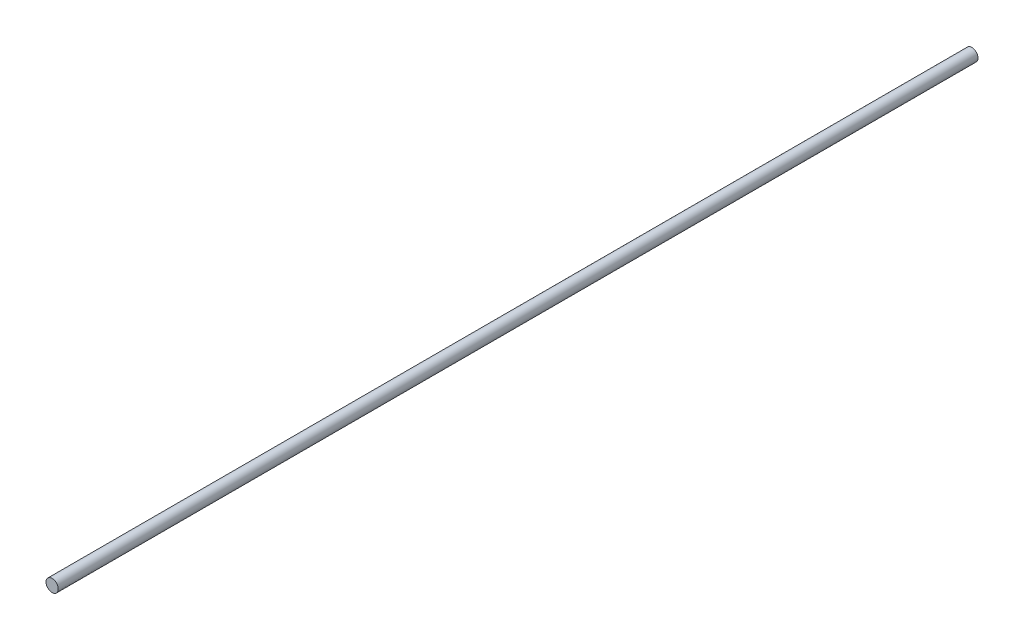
ISO-10303-21;
HEADER;
FILE_DESCRIPTION(('STEP AP214'),'2;1');
FILE_NAME('part.step','',(''),(''),'','','');
FILE_SCHEMA(('AUTOMOTIVE_DESIGN { 1 0 10303 214 1 1 1 1 }'));
ENDSEC;
DATA;
#1=APPLICATION_CONTEXT('core data for automotive mechanical design processes');
#2=APPLICATION_PROTOCOL_DEFINITION('international standard','automotive_design',2000,#1);
#3=PRODUCT_CONTEXT('',#1,'mechanical');
#4=PRODUCT('Part','Part','',(#3));
#5=PRODUCT_RELATED_PRODUCT_CATEGORY('part','',(#4));
#6=PRODUCT_DEFINITION_FORMATION('','',#4);
#7=PRODUCT_DEFINITION_CONTEXT('part definition',#1,'design');
#8=PRODUCT_DEFINITION('design','',#6,#7);
#9=PRODUCT_DEFINITION_SHAPE('','',#8);
#10=(LENGTH_UNIT() NAMED_UNIT(*) SI_UNIT(.MILLI.,.METRE.));
#11=(NAMED_UNIT(*) PLANE_ANGLE_UNIT() SI_UNIT($,.RADIAN.));
#12=(NAMED_UNIT(*) SI_UNIT($,.STERADIAN.) SOLID_ANGLE_UNIT());
#13=UNCERTAINTY_MEASURE_WITH_UNIT(LENGTH_MEASURE(1.E-05),#10,'distance_accuracy_value','');
#14=(GEOMETRIC_REPRESENTATION_CONTEXT(3) GLOBAL_UNCERTAINTY_ASSIGNED_CONTEXT((#13)) GLOBAL_UNIT_ASSIGNED_CONTEXT((#10,
#11,#12)) REPRESENTATION_CONTEXT('',''));
#15=CARTESIAN_POINT('',(0.,0.,0.));
#16=DIRECTION('',(0.,0.,1.));
#17=DIRECTION('',(1.,0.,0.));
#18=AXIS2_PLACEMENT_3D('',#15,#16,#17);
#19=CARTESIAN_POINT('',(0.,0.,450.));
#20=DIRECTION('',(0.,0.,-1.));
#21=DIRECTION('',(-1.,0.,0.));
#22=AXIS2_PLACEMENT_3D('',#19,#20,#21);
#23=CYLINDRICAL_SURFACE('',#22,3.);
#24=CARTESIAN_POINT('',(0.,0.,450.));
#25=DIRECTION('',(0.,0.,1.));
#26=DIRECTION('',(1.,0.,0.));
#27=AXIS2_PLACEMENT_3D('',#24,#25,#26);
#28=CIRCLE('',#27,3.);
#29=CARTESIAN_POINT('',(3.,0.,450.));
#30=VERTEX_POINT('',#29);
#31=EDGE_CURVE('E10',#30,#30,#28,.T.);
#32=ORIENTED_EDGE('',*,*,#31,.F.);
#33=EDGE_LOOP('',(#32));
#34=FACE_BOUND('',#33,.T.);
#35=CARTESIAN_POINT('',(0.,0.,0.));
#36=DIRECTION('',(0.,0.,1.));
#37=DIRECTION('',(1.,0.,0.));
#38=AXIS2_PLACEMENT_3D('',#35,#36,#37);
#39=CIRCLE('',#38,3.);
#40=CARTESIAN_POINT('',(3.,0.,0.));
#41=VERTEX_POINT('',#40);
#42=EDGE_CURVE('E33',#41,#41,#39,.T.);
#43=ORIENTED_EDGE('',*,*,#42,.T.);
#44=EDGE_LOOP('',(#43));
#45=FACE_BOUND('',#44,.T.);
#46=ADVANCED_FACE('F30',(#34,#45),#23,.T.);
#47=CARTESIAN_POINT('',(0.,0.,450.));
#48=DIRECTION('',(0.,0.,1.));
#49=DIRECTION('',(1.,0.,0.));
#50=AXIS2_PLACEMENT_3D('',#47,#48,#49);
#51=PLANE('',#50);
#52=ORIENTED_EDGE('',*,*,#31,.T.);
#53=EDGE_LOOP('',(#52));
#54=FACE_BOUND('',#53,.T.);
#55=ADVANCED_FACE('F45',(#54),#51,.T.);
#56=CARTESIAN_POINT('',(0.,0.,0.));
#57=DIRECTION('',(0.,0.,1.));
#58=DIRECTION('',(1.,0.,0.));
#59=AXIS2_PLACEMENT_3D('',#56,#57,#58);
#60=PLANE('',#59);
#61=ORIENTED_EDGE('',*,*,#42,.F.);
#62=EDGE_LOOP('',(#61));
#63=FACE_BOUND('',#62,.T.);
#64=ADVANCED_FACE('F43',(#63),#60,.F.);
#65=CLOSED_SHELL('',(#46,#55,#64));
#66=MANIFOLD_SOLID_BREP('B2',#65);
#67=ADVANCED_BREP_SHAPE_REPRESENTATION('',(#18,#66),#14);
#68=SHAPE_DEFINITION_REPRESENTATION(#9,#67);
ENDSEC;
END-ISO-10303-21;
